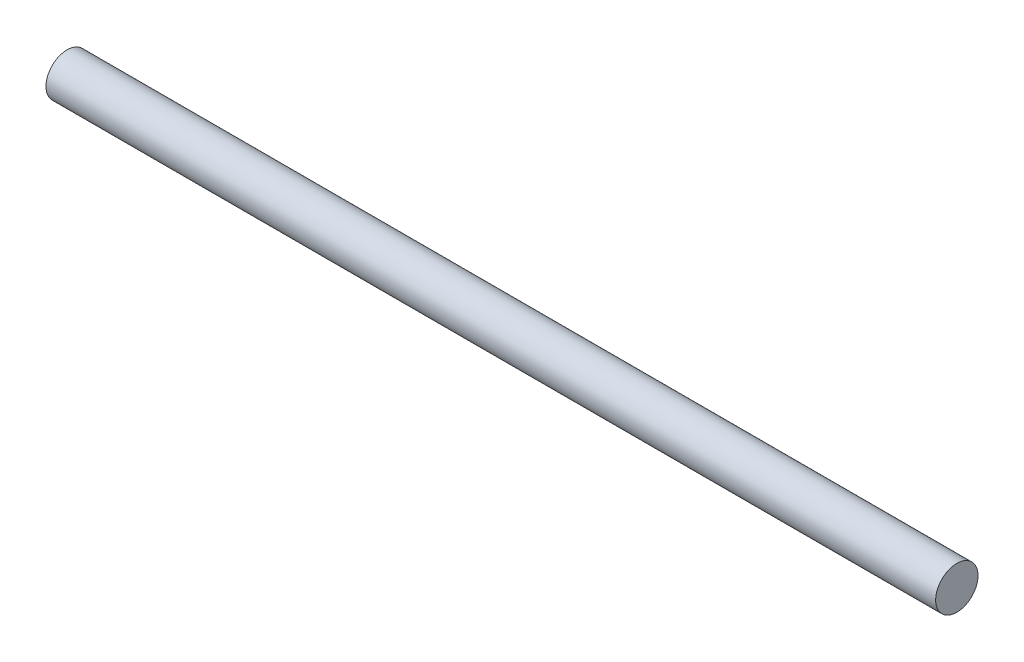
ISO-10303-21;
HEADER;
FILE_DESCRIPTION(('STEP AP214'),'2;1');
FILE_NAME('part.step','',(''),(''),'','','');
FILE_SCHEMA(('AUTOMOTIVE_DESIGN { 1 0 10303 214 1 1 1 1 }'));
ENDSEC;
DATA;
#1=APPLICATION_CONTEXT('core data for automotive mechanical design processes');
#2=APPLICATION_PROTOCOL_DEFINITION('international standard','automotive_design',2000,#1);
#3=PRODUCT_CONTEXT('',#1,'mechanical');
#4=PRODUCT('Part','Part','',(#3));
#5=PRODUCT_RELATED_PRODUCT_CATEGORY('part','',(#4));
#6=PRODUCT_DEFINITION_FORMATION('','',#4);
#7=PRODUCT_DEFINITION_CONTEXT('part definition',#1,'design');
#8=PRODUCT_DEFINITION('design','',#6,#7);
#9=PRODUCT_DEFINITION_SHAPE('','',#8);
#10=(LENGTH_UNIT() NAMED_UNIT(*) SI_UNIT(.MILLI.,.METRE.));
#11=(NAMED_UNIT(*) PLANE_ANGLE_UNIT() SI_UNIT($,.RADIAN.));
#12=(NAMED_UNIT(*) SI_UNIT($,.STERADIAN.) SOLID_ANGLE_UNIT());
#13=UNCERTAINTY_MEASURE_WITH_UNIT(LENGTH_MEASURE(1.E-05),#10,'distance_accuracy_value','');
#14=(GEOMETRIC_REPRESENTATION_CONTEXT(3) GLOBAL_UNCERTAINTY_ASSIGNED_CONTEXT((#13)) GLOBAL_UNIT_ASSIGNED_CONTEXT((#10,
#11,#12)) REPRESENTATION_CONTEXT('',''));
#15=CARTESIAN_POINT('',(0.,0.,0.));
#16=DIRECTION('',(0.,0.,1.));
#17=DIRECTION('',(1.,0.,0.));
#18=AXIS2_PLACEMENT_3D('',#15,#16,#17);
#19=CARTESIAN_POINT('',(400.,0.,0.));
#20=DIRECTION('',(-1.,0.,0.));
#21=DIRECTION('',(0.,0.,1.));
#22=AXIS2_PLACEMENT_3D('',#19,#20,#21);
#23=CYLINDRICAL_SURFACE('',#22,9.525);
#24=CARTESIAN_POINT('',(400.,0.,0.));
#25=DIRECTION('',(1.,0.,0.));
#26=DIRECTION('',(0.,0.,-1.));
#27=AXIS2_PLACEMENT_3D('',#24,#25,#26);
#28=CIRCLE('',#27,9.525);
#29=CARTESIAN_POINT('',(400.,0.,-9.525));
#30=VERTEX_POINT('',#29);
#31=EDGE_CURVE('E10',#30,#30,#28,.T.);
#32=ORIENTED_EDGE('',*,*,#31,.F.);
#33=EDGE_LOOP('',(#32));
#34=FACE_BOUND('',#33,.T.);
#35=CARTESIAN_POINT('',(0.,0.,0.));
#36=DIRECTION('',(1.,0.,0.));
#37=DIRECTION('',(0.,0.,-1.));
#38=AXIS2_PLACEMENT_3D('',#35,#36,#37);
#39=CIRCLE('',#38,9.525);
#40=CARTESIAN_POINT('',(0.,0.,-9.525));
#41=VERTEX_POINT('',#40);
#42=EDGE_CURVE('E46',#41,#41,#39,.T.);
#43=ORIENTED_EDGE('',*,*,#42,.T.);
#44=EDGE_LOOP('',(#43));
#45=FACE_BOUND('',#44,.T.);
#46=ADVANCED_FACE('F43',(#34,#45),#23,.T.);
#47=CARTESIAN_POINT('',(400.,0.,0.));
#48=DIRECTION('',(1.,0.,0.));
#49=DIRECTION('',(0.,0.,-1.));
#50=AXIS2_PLACEMENT_3D('',#47,#48,#49);
#51=PLANE('',#50);
#52=ORIENTED_EDGE('',*,*,#31,.T.);
#53=EDGE_LOOP('',(#52));
#54=FACE_BOUND('',#53,.T.);
#55=ADVANCED_FACE('F60',(#54),#51,.T.);
#56=CARTESIAN_POINT('',(0.,0.,0.));
#57=DIRECTION('',(1.,0.,0.));
#58=DIRECTION('',(0.,0.,-1.));
#59=AXIS2_PLACEMENT_3D('',#56,#57,#58);
#60=PLANE('',#59);
#61=ORIENTED_EDGE('',*,*,#42,.F.);
#62=EDGE_LOOP('',(#61));
#63=FACE_BOUND('',#62,.T.);
#64=ADVANCED_FACE('F58',(#63),#60,.F.);
#65=CLOSED_SHELL('',(#46,#55,#64));
#66=MANIFOLD_SOLID_BREP('B2',#65);
#67=ADVANCED_BREP_SHAPE_REPRESENTATION('',(#18,#66),#14);
#68=SHAPE_DEFINITION_REPRESENTATION(#9,#67);
ENDSEC;
END-ISO-10303-21;
